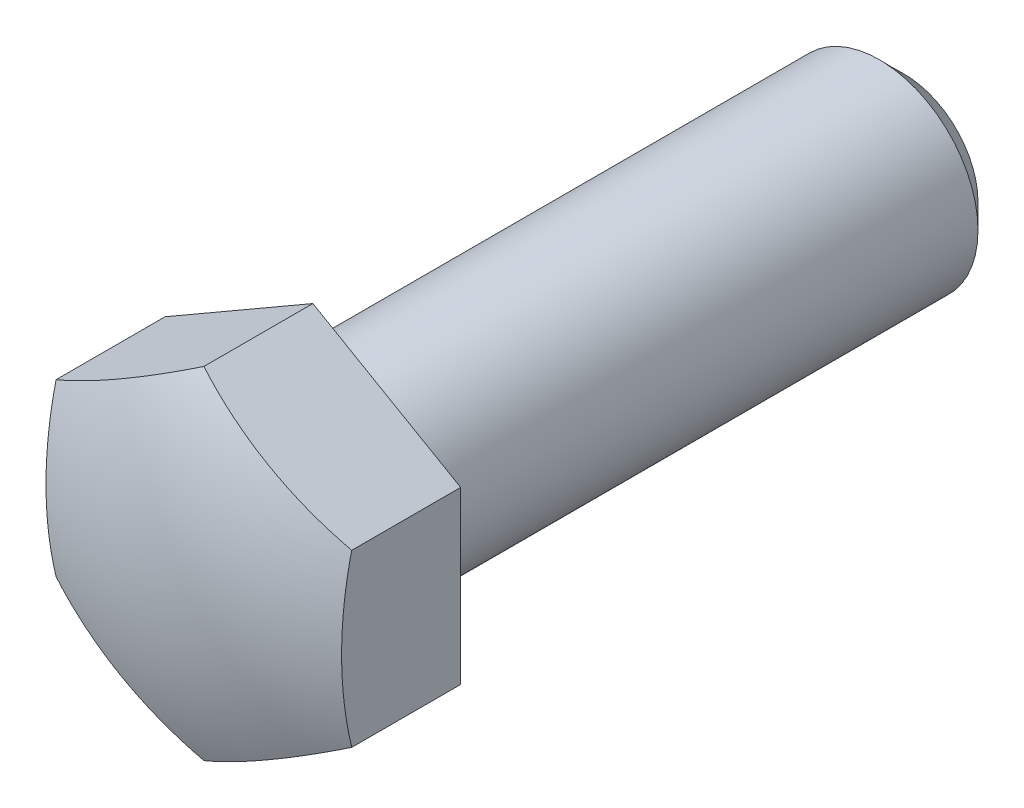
ISO-10303-21;
HEADER;
FILE_DESCRIPTION(('STEP AP214'),'2;1');
FILE_NAME('part.step','',(''),(''),'','','');
FILE_SCHEMA(('AUTOMOTIVE_DESIGN { 1 0 10303 214 1 1 1 1 }'));
ENDSEC;
DATA;
#1=APPLICATION_CONTEXT('core data for automotive mechanical design processes');
#2=APPLICATION_PROTOCOL_DEFINITION('international standard','automotive_design',2000,#1);
#3=PRODUCT_CONTEXT('',#1,'mechanical');
#4=PRODUCT('Part','Part','',(#3));
#5=PRODUCT_RELATED_PRODUCT_CATEGORY('part','',(#4));
#6=PRODUCT_DEFINITION_FORMATION('','',#4);
#7=PRODUCT_DEFINITION_CONTEXT('part definition',#1,'design');
#8=PRODUCT_DEFINITION('design','',#6,#7);
#9=PRODUCT_DEFINITION_SHAPE('','',#8);
#10=(LENGTH_UNIT() NAMED_UNIT(*) SI_UNIT(.MILLI.,.METRE.));
#11=(NAMED_UNIT(*) PLANE_ANGLE_UNIT() SI_UNIT($,.RADIAN.));
#12=(NAMED_UNIT(*) SI_UNIT($,.STERADIAN.) SOLID_ANGLE_UNIT());
#13=UNCERTAINTY_MEASURE_WITH_UNIT(LENGTH_MEASURE(1.E-05),#10,'distance_accuracy_value','');
#14=(GEOMETRIC_REPRESENTATION_CONTEXT(3) GLOBAL_UNCERTAINTY_ASSIGNED_CONTEXT((#13)) GLOBAL_UNIT_ASSIGNED_CONTEXT((#10,
#11,#12)) REPRESENTATION_CONTEXT('',''));
#15=CARTESIAN_POINT('',(0.,0.,0.));
#16=DIRECTION('',(0.,0.,1.));
#17=DIRECTION('',(1.,0.,0.));
#18=AXIS2_PLACEMENT_3D('',#15,#16,#17);
#19=CARTESIAN_POINT('',(10.,0.,0.));
#20=DIRECTION('',(0.,0.,1.));
#21=DIRECTION('',(1.,0.,0.));
#22=AXIS2_PLACEMENT_3D('',#19,#20,#21);
#23=PLANE('',#22);
#24=CARTESIAN_POINT('',(0.,0.,0.));
#25=DIRECTION('',(0.,0.,1.));
#26=DIRECTION('',(1.,0.,0.));
#27=AXIS2_PLACEMENT_3D('',#24,#25,#26);
#28=CIRCLE('',#27,10.);
#29=CARTESIAN_POINT('',(10.,0.,0.));
#30=VERTEX_POINT('',#29);
#31=EDGE_CURVE('E115',#30,#30,#28,.T.);
#32=ORIENTED_EDGE('',*,*,#31,.T.);
#33=EDGE_LOOP('',(#32));
#34=FACE_BOUND('',#33,.T.);
#35=DIRECTION('',(-0.86602540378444,-0.5,0.));
#36=VECTOR('',#35,1.);
#37=CARTESIAN_POINT('',(15.,-8.66025403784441,0.));
#38=LINE('',#37,#36);
#39=CARTESIAN_POINT('',(15.,-8.66025403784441,0.));
#40=VERTEX_POINT('',#39);
#41=CARTESIAN_POINT('',(0.,-17.3205080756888,0.));
#42=VERTEX_POINT('',#41);
#43=EDGE_CURVE('E89',#40,#42,#38,.T.);
#44=ORIENTED_EDGE('',*,*,#43,.T.);
#45=DIRECTION('',(0.86602540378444,-0.5,0.));
#46=VECTOR('',#45,1.);
#47=CARTESIAN_POINT('',(-15.,-8.66025403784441,0.));
#48=LINE('',#47,#46);
#49=CARTESIAN_POINT('',(-15.,-8.66025403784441,0.));
#50=VERTEX_POINT('',#49);
#51=EDGE_CURVE('E87',#50,#42,#48,.T.);
#52=ORIENTED_EDGE('',*,*,#51,.F.);
#53=DIRECTION('',(0.,-1.,0.));
#54=VECTOR('',#53,1.);
#55=CARTESIAN_POINT('',(-15.,8.66025403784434,0.));
#56=LINE('',#55,#54);
#57=CARTESIAN_POINT('',(-15.,8.66025403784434,0.));
#58=VERTEX_POINT('',#57);
#59=EDGE_CURVE('E37',#58,#50,#56,.T.);
#60=ORIENTED_EDGE('',*,*,#59,.F.);
#61=DIRECTION('',(0.866025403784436,0.5,0.));
#62=VECTOR('',#61,1.);
#63=CARTESIAN_POINT('',(-15.,8.66025403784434,0.));
#64=LINE('',#63,#62);
#65=CARTESIAN_POINT('',(0.,17.3205080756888,0.));
#66=VERTEX_POINT('',#65);
#67=EDGE_CURVE('E77',#58,#66,#64,.T.);
#68=ORIENTED_EDGE('',*,*,#67,.T.);
#69=DIRECTION('',(-0.866025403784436,0.5,0.));
#70=VECTOR('',#69,1.);
#71=CARTESIAN_POINT('',(15.,8.66025403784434,0.));
#72=LINE('',#71,#70);
#73=CARTESIAN_POINT('',(15.,8.66025403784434,0.));
#74=VERTEX_POINT('',#73);
#75=EDGE_CURVE('E83',#74,#66,#72,.T.);
#76=ORIENTED_EDGE('',*,*,#75,.F.);
#77=DIRECTION('',(0.,-1.,0.));
#78=VECTOR('',#77,1.);
#79=CARTESIAN_POINT('',(15.,8.66025403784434,0.));
#80=LINE('',#79,#78);
#81=EDGE_CURVE('E95',#74,#40,#80,.T.);
#82=ORIENTED_EDGE('',*,*,#81,.T.);
#83=EDGE_LOOP('',(#44,#52,#60,#68,#76,#82));
#84=FACE_BOUND('',#83,.T.);
#85=ADVANCED_FACE('F14',(#34,#84),#23,.F.);
#86=CARTESIAN_POINT('',(0.,0.,0.));
#87=DIRECTION('',(0.,0.,1.));
#88=DIRECTION('',(1.,0.,0.));
#89=AXIS2_PLACEMENT_3D('',#86,#87,#88);
#90=CYLINDRICAL_SURFACE('',#89,10.);
#91=CARTESIAN_POINT('',(0.,0.,-57.5));
#92=DIRECTION('',(0.,0.,1.));
#93=DIRECTION('',(1.,0.,0.));
#94=AXIS2_PLACEMENT_3D('',#91,#92,#93);
#95=CIRCLE('',#94,10.);
#96=CARTESIAN_POINT('',(10.,0.,-57.5));
#97=VERTEX_POINT('',#96);
#98=EDGE_CURVE('E22',#97,#97,#95,.T.);
#99=ORIENTED_EDGE('',*,*,#98,.T.);
#100=EDGE_LOOP('',(#99));
#101=FACE_BOUND('',#100,.T.);
#102=ORIENTED_EDGE('',*,*,#31,.F.);
#103=EDGE_LOOP('',(#102));
#104=FACE_BOUND('',#103,.T.);
#105=ADVANCED_FACE('F120',(#101,#104),#90,.T.);
#106=CARTESIAN_POINT('',(0.,0.,-60.));
#107=DIRECTION('',(0.,0.,1.));
#108=DIRECTION('',(1.,0.,0.));
#109=AXIS2_PLACEMENT_3D('',#106,#107,#108);
#110=PLANE('',#109);
#111=CARTESIAN_POINT('',(0.,0.,-60.));
#112=DIRECTION('',(0.,0.,1.));
#113=DIRECTION('',(1.,0.,0.));
#114=AXIS2_PLACEMENT_3D('',#111,#112,#113);
#115=CIRCLE('',#114,7.5);
#116=CARTESIAN_POINT('',(7.5,0.,-60.));
#117=VERTEX_POINT('',#116);
#118=EDGE_CURVE('E9',#117,#117,#115,.F.);
#119=ORIENTED_EDGE('',*,*,#118,.T.);
#120=EDGE_LOOP('',(#119));
#121=FACE_BOUND('',#120,.T.);
#122=ADVANCED_FACE('F141',(#121),#110,.F.);
#123=CARTESIAN_POINT('',(15.,-8.66025403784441,15.));
#124=DIRECTION('',(0.5,-0.86602540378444,0.));
#125=DIRECTION('',(0.86602540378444,0.5,0.));
#126=AXIS2_PLACEMENT_3D('',#123,#124,#125);
#127=PLANE('',#126);
#128=DIRECTION('',(0.,0.,-1.));
#129=VECTOR('',#128,1.);
#130=CARTESIAN_POINT('',(0.,-17.3205080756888,15.));
#131=LINE('',#130,#129);
#132=CARTESIAN_POINT('',(0.,-17.3205080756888,11.0555127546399));
#133=VERTEX_POINT('',#132);
#134=EDGE_CURVE('E29',#133,#42,#131,.T.);
#135=ORIENTED_EDGE('',*,*,#134,.T.);
#136=ORIENTED_EDGE('',*,*,#43,.F.);
#137=DIRECTION('',(0.,0.,-1.));
#138=VECTOR('',#137,1.);
#139=CARTESIAN_POINT('',(15.,-8.66025403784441,15.));
#140=LINE('',#139,#138);
#141=CARTESIAN_POINT('',(15.,-8.66025403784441,11.0555127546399));
#142=VERTEX_POINT('',#141);
#143=EDGE_CURVE('E100',#142,#40,#140,.T.);
#144=ORIENTED_EDGE('',*,*,#143,.F.);
#145=CARTESIAN_POINT('',(7.5,-12.9903810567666,-25.));
#146=DIRECTION('',(0.5,-0.86602540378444,0.));
#147=DIRECTION('',(0.86602540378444,0.5,0.));
#148=AXIS2_PLACEMENT_3D('',#145,#146,#147);
#149=CIRCLE('',#148,37.0809924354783);
#150=EDGE_CURVE('E112',#133,#142,#149,.F.);
#151=ORIENTED_EDGE('',*,*,#150,.F.);
#152=EDGE_LOOP('',(#135,#136,#144,#151));
#153=FACE_BOUND('',#152,.T.);
#154=ADVANCED_FACE('F146',(#153),#127,.T.);
#155=CARTESIAN_POINT('',(15.,8.66025403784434,15.));
#156=DIRECTION('',(1.,0.,0.));
#157=DIRECTION('',(0.,1.,0.));
#158=AXIS2_PLACEMENT_3D('',#155,#156,#157);
#159=PLANE('',#158);
#160=ORIENTED_EDGE('',*,*,#143,.T.);
#161=ORIENTED_EDGE('',*,*,#81,.F.);
#162=DIRECTION('',(0.,0.,-1.));
#163=VECTOR('',#162,1.);
#164=CARTESIAN_POINT('',(15.,8.66025403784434,15.));
#165=LINE('',#164,#163);
#166=CARTESIAN_POINT('',(15.,8.66025403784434,11.0555127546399));
#167=VERTEX_POINT('',#166);
#168=EDGE_CURVE('E98',#167,#74,#165,.T.);
#169=ORIENTED_EDGE('',*,*,#168,.F.);
#170=CARTESIAN_POINT('',(15.,0.,-25.));
#171=DIRECTION('',(1.,0.,0.));
#172=DIRECTION('',(0.,1.,0.));
#173=AXIS2_PLACEMENT_3D('',#170,#171,#172);
#174=CIRCLE('',#173,37.0809924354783);
#175=EDGE_CURVE('E109',#142,#167,#174,.F.);
#176=ORIENTED_EDGE('',*,*,#175,.F.);
#177=EDGE_LOOP('',(#160,#161,#169,#176));
#178=FACE_BOUND('',#177,.T.);
#179=ADVANCED_FACE('F148',(#178),#159,.T.);
#180=CARTESIAN_POINT('',(15.,8.66025403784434,15.));
#181=DIRECTION('',(-0.5,-0.866025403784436,0.));
#182=DIRECTION('',(0.866025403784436,-0.5,0.));
#183=AXIS2_PLACEMENT_3D('',#180,#181,#182);
#184=PLANE('',#183);
#185=CARTESIAN_POINT('',(7.5,12.9903810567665,-25.));
#186=DIRECTION('',(-0.5,-0.866025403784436,0.));
#187=DIRECTION('',(0.866025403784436,-0.5,0.));
#188=AXIS2_PLACEMENT_3D('',#185,#186,#187);
#189=CIRCLE('',#188,37.0809924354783);
#190=CARTESIAN_POINT('',(0.,17.3205080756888,11.0555127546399));
#191=VERTEX_POINT('',#190);
#192=EDGE_CURVE('E107',#191,#167,#189,.F.);
#193=ORIENTED_EDGE('',*,*,#192,.T.);
#194=ORIENTED_EDGE('',*,*,#168,.T.);
#195=ORIENTED_EDGE('',*,*,#75,.T.);
#196=DIRECTION('',(0.,0.,-1.));
#197=VECTOR('',#196,1.);
#198=CARTESIAN_POINT('',(0.,17.3205080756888,15.));
#199=LINE('',#198,#197);
#200=EDGE_CURVE('E73',#191,#66,#199,.T.);
#201=ORIENTED_EDGE('',*,*,#200,.F.);
#202=EDGE_LOOP('',(#193,#194,#195,#201));
#203=FACE_BOUND('',#202,.T.);
#204=ADVANCED_FACE('F151',(#203),#184,.F.);
#205=CARTESIAN_POINT('',(-15.,8.66025403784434,15.));
#206=DIRECTION('',(-0.5,0.866025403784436,0.));
#207=DIRECTION('',(-0.866025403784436,-0.5,0.));
#208=AXIS2_PLACEMENT_3D('',#205,#206,#207);
#209=PLANE('',#208);
#210=ORIENTED_EDGE('',*,*,#200,.T.);
#211=ORIENTED_EDGE('',*,*,#67,.F.);
#212=DIRECTION('',(0.,0.,-1.));
#213=VECTOR('',#212,1.);
#214=CARTESIAN_POINT('',(-15.,8.66025403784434,15.));
#215=LINE('',#214,#213);
#216=CARTESIAN_POINT('',(-15.,8.66025403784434,11.0555127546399));
#217=VERTEX_POINT('',#216);
#218=EDGE_CURVE('E66',#217,#58,#215,.T.);
#219=ORIENTED_EDGE('',*,*,#218,.F.);
#220=CARTESIAN_POINT('',(-7.5,12.9903810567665,-25.));
#221=DIRECTION('',(-0.5,0.866025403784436,0.));
#222=DIRECTION('',(-0.866025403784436,-0.5,0.));
#223=AXIS2_PLACEMENT_3D('',#220,#221,#222);
#224=CIRCLE('',#223,37.0809924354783);
#225=EDGE_CURVE('E105',#191,#217,#224,.F.);
#226=ORIENTED_EDGE('',*,*,#225,.F.);
#227=EDGE_LOOP('',(#210,#211,#219,#226));
#228=FACE_BOUND('',#227,.T.);
#229=ADVANCED_FACE('F78',(#228),#209,.T.);
#230=CARTESIAN_POINT('',(-15.,8.66025403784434,15.));
#231=DIRECTION('',(1.,0.,0.));
#232=DIRECTION('',(0.,1.,0.));
#233=AXIS2_PLACEMENT_3D('',#230,#231,#232);
#234=PLANE('',#233);
#235=CARTESIAN_POINT('',(-15.,0.,-25.));
#236=DIRECTION('',(1.,0.,0.));
#237=DIRECTION('',(0.,1.,0.));
#238=AXIS2_PLACEMENT_3D('',#235,#236,#237);
#239=CIRCLE('',#238,37.0809924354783);
#240=CARTESIAN_POINT('',(-15.,-8.66025403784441,11.0555127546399));
#241=VERTEX_POINT('',#240);
#242=EDGE_CURVE('E70',#241,#217,#239,.F.);
#243=ORIENTED_EDGE('',*,*,#242,.T.);
#244=ORIENTED_EDGE('',*,*,#218,.T.);
#245=ORIENTED_EDGE('',*,*,#59,.T.);
#246=DIRECTION('',(0.,0.,-1.));
#247=VECTOR('',#246,1.);
#248=CARTESIAN_POINT('',(-15.,-8.66025403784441,15.));
#249=LINE('',#248,#247);
#250=EDGE_CURVE('E74',#241,#50,#249,.T.);
#251=ORIENTED_EDGE('',*,*,#250,.F.);
#252=EDGE_LOOP('',(#243,#244,#245,#251));
#253=FACE_BOUND('',#252,.T.);
#254=ADVANCED_FACE('F68',(#253),#234,.F.);
#255=CARTESIAN_POINT('',(-15.,-8.66025403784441,15.));
#256=DIRECTION('',(0.5,0.86602540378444,0.));
#257=DIRECTION('',(-0.86602540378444,0.5,0.));
#258=AXIS2_PLACEMENT_3D('',#255,#256,#257);
#259=PLANE('',#258);
#260=CARTESIAN_POINT('',(-7.5,-12.9903810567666,-25.));
#261=DIRECTION('',(0.5,0.86602540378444,0.));
#262=DIRECTION('',(-0.86602540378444,0.5,0.));
#263=AXIS2_PLACEMENT_3D('',#260,#261,#262);
#264=CIRCLE('',#263,37.0809924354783);
#265=EDGE_CURVE('E102',#133,#241,#264,.F.);
#266=ORIENTED_EDGE('',*,*,#265,.T.);
#267=ORIENTED_EDGE('',*,*,#250,.T.);
#268=ORIENTED_EDGE('',*,*,#51,.T.);
#269=ORIENTED_EDGE('',*,*,#134,.F.);
#270=EDGE_LOOP('',(#266,#267,#268,#269));
#271=FACE_BOUND('',#270,.T.);
#272=ADVANCED_FACE('F131',(#271),#259,.F.);
#273=CARTESIAN_POINT('',(0.,0.,-25.));
#274=DIRECTION('',(0.,0.,1.));
#275=DIRECTION('',(1.,0.,0.));
#276=AXIS2_PLACEMENT_3D('',#273,#274,#275);
#277=SPHERICAL_SURFACE('',#276,40.);
#278=ORIENTED_EDGE('',*,*,#265,.F.);
#279=ORIENTED_EDGE('',*,*,#150,.T.);
#280=ORIENTED_EDGE('',*,*,#175,.T.);
#281=ORIENTED_EDGE('',*,*,#192,.F.);
#282=ORIENTED_EDGE('',*,*,#225,.T.);
#283=ORIENTED_EDGE('',*,*,#242,.F.);
#284=EDGE_LOOP('',(#278,#279,#280,#281,#282,#283));
#285=FACE_BOUND('',#284,.T.);
#286=ADVANCED_FACE('F124',(#285),#277,.T.);
#287=CARTESIAN_POINT('',(0.,0.,-57.5));
#288=DIRECTION('',(0.,0.,1.));
#289=DIRECTION('',(1.,0.,0.));
#290=AXIS2_PLACEMENT_3D('',#287,#288,#289);
#291=CONICAL_SURFACE('',#290,10.,0.785398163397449);
#292=ORIENTED_EDGE('',*,*,#118,.F.);
#293=EDGE_LOOP('',(#292));
#294=FACE_BOUND('',#293,.T.);
#295=ORIENTED_EDGE('',*,*,#98,.F.);
#296=EDGE_LOOP('',(#295));
#297=FACE_BOUND('',#296,.T.);
#298=ADVANCED_FACE('F16',(#294,#297),#291,.T.);
#299=CLOSED_SHELL('',(#85,#105,#122,#154,#179,#204,#229,#254,#272,#286,#298));
#300=MANIFOLD_SOLID_BREP('B1',#299);
#301=ADVANCED_BREP_SHAPE_REPRESENTATION('',(#18,#300),#14);
#302=SHAPE_DEFINITION_REPRESENTATION(#9,#301);
ENDSEC;
END-ISO-10303-21;
